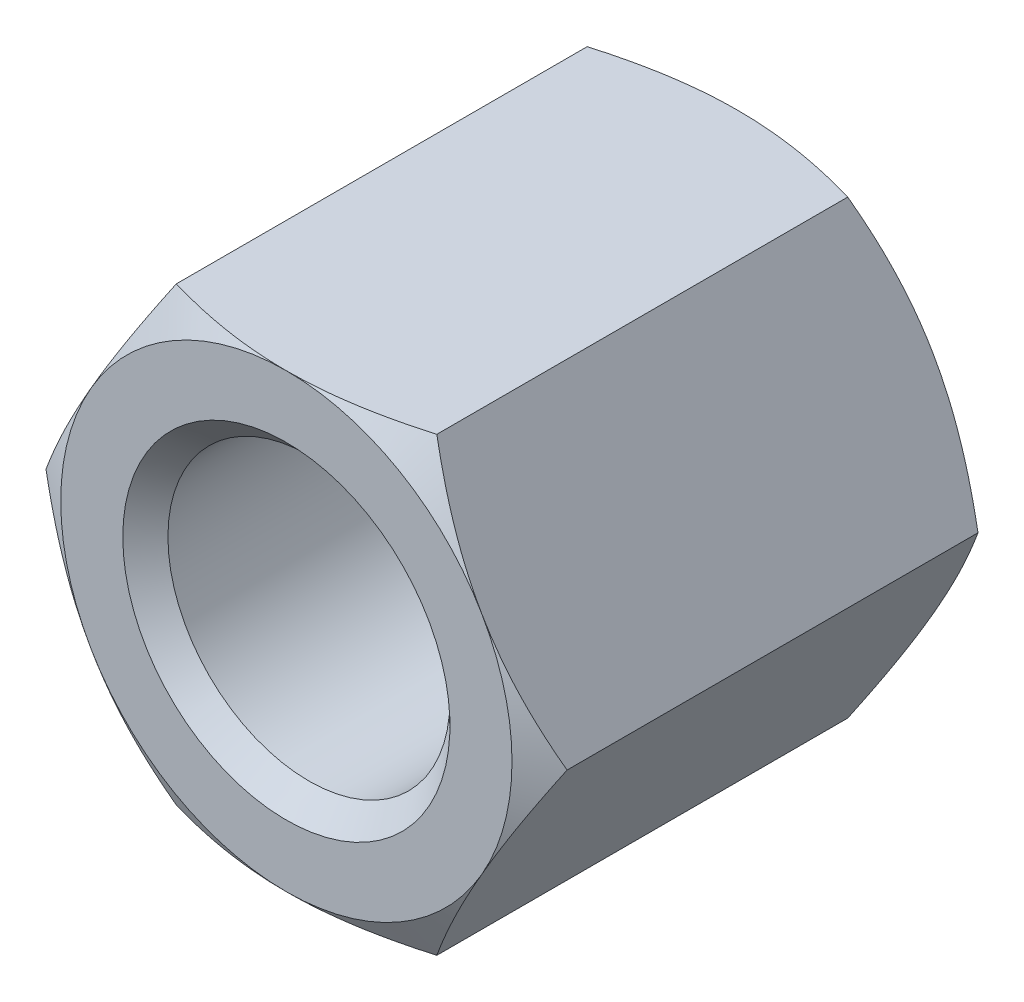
from build123d import *

# Parameters (mm, degrees)
BOSS_EXTRUDE1_DEPTH      = 4
SKETCH2_OUTSIDE_W        = 42.572
SKETCH2_OUTSIDE_H        = 41.334
SKETCH2_OUTSIDE_R        = 4
CUT_EXTRUDE1_DEPTH       = 8.302967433
CUT_EXTRUDE1_DRAFT       = -60
SKETCH3_R                = 2.5
SKETCH3_R_2              = 2.1
CUT_EXTRUDE2_DEPTH       = 4
SKETCH3_2_R              = 2.1
CUT_EXTRUDE3_DEPTH       = 5.2
CHAMFER1_SIZE            = 0.4
MIRROR1_COPY_1_SKETCH_W  = 42.572
MIRROR1_COPY_1_SKETCH_H  = 41.334
MIRROR1_COPY_1_SKETCH_R  = 4
MIRROR1_COPY_1_DEPTH     = 8.302967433
MIRROR1_COPY_1_DRAFT     = -60
CHAMFER1_OF_MIRROR1_SIZE = 0.4


with BuildPart() as part:
    # Sketch1 → Boss-Extrude1 (new body)
    with BuildSketch(Plane.XY):
        Polygon((2.309401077, 4), (-2.309401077, 4), (-4.618802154, 0), (-2.309401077, -4), (2.309401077, -4), (4.618802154, 0), align=None)
    boss_extrude1 = extrude(amount=-BOSS_EXTRUDE1_DEPTH)


with BuildPart() as cut_extrude1_tool:
    # Sketch2 outside → Cut-Extrude1 (with draft: the straight prism first)
    with BuildSketch(Plane(origin=(0, 0, -4), x_dir=(-1, 0, 0), z_dir=(0, 0, -1))):
        Rectangle(SKETCH2_OUTSIDE_W, SKETCH2_OUTSIDE_H)
        Circle(SKETCH2_OUTSIDE_R, mode=Mode.SUBTRACT)
    extrude(amount=-CUT_EXTRUDE1_DEPTH)
    # Cut-Extrude1: the draft: its side faces are tilted about the plane it starts from
    cut_extrude1_sides = [cut_extrude1_tool.faces().sort_by_distance(p)[0] for p in [
        (0, -20.667, 0.151483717),
        (-21.286, 0, 0.151483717),
        (0, 20.667, 0.151483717),
        (21.286, 0, 0.151483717),
        (4, 0, 0.151483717),
    ]]
    draft(cut_extrude1_sides, Plane(origin=(0, 0, -4), x_dir=(-1, 0, 0), z_dir=(0, 0, -1)), CUT_EXTRUDE1_DRAFT)


with BuildPart() as part_1:
    add(part.part)

    # Cut-Extrude1: cut by cut_extrude1_tool
    add(cut_extrude1_tool.part, mode=Mode.SUBTRACT)

    # Sketch3 → Cut-Extrude2 (cut)
    with BuildSketch(Plane(origin=(0, 0, -4), x_dir=(-1, 0, 0), z_dir=(0, 0, -1))):
        Circle(SKETCH3_R)
        Circle(SKETCH3_R_2, mode=Mode.SUBTRACT)
    cut_extrude2 = extrude(amount=-CUT_EXTRUDE2_DEPTH, mode=Mode.SUBTRACT)


with BuildPart() as cut_extrude2_piece_1:
    # of the separate pieces the step leaves, piece 1, a body of its own (cut_extrude2_pieces)
    add(part_1.part.solids().sort_by_distance((2.309401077, 4, 0))[0])

    # Chamfer1
    chamfer1_edges = [cut_extrude2_piece_1.edges().sort_by_distance(p)[0] for p in [
        (2.5, 0, -4),
    ]]
    chamfer(chamfer1_edges, length=CHAMFER1_SIZE)


with BuildPart() as cut_extrude2_piece_2:
    # of the separate pieces the step leaves, piece 2, a body of its own (cut_extrude2_pieces)
    add(part_1.part.solids().sort_by_distance((-2.1, 0, 0))[0])

    # Sketch3_2 → Cut-Extrude3 (cut)
    with BuildSketch(Plane(origin=(0, 0, -4), x_dir=(-1, 0, 0), z_dir=(0, 0, -1))):
        Circle(SKETCH3_2_R)
    cut_extrude3 = extrude(amount=-CUT_EXTRUDE3_DEPTH, mode=Mode.SUBTRACT)


with BuildPart() as cut_extrude2_piece_1_1:
    add(cut_extrude2_piece_1.part)

    # Mirror1: Boss-Extrude1, Cut-Extrude2, Cut-Extrude3 across plane
    add(boss_extrude1.mirror(Plane.XY))
    add(cut_extrude2.mirror(Plane.XY), mode=Mode.SUBTRACT)
    add(cut_extrude3.mirror(Plane.XY), mode=Mode.SUBTRACT)


with BuildPart() as mirror1_copy_1_tool:
    # Mirror1 copy 1 sketch → Mirror1 copy 1 (with draft: the straight prism first)
    with BuildSketch(Plane(origin=(0, 0, 4), x_dir=(-1, 0, 0), z_dir=(0, 0, 1))):
        Rectangle(MIRROR1_COPY_1_SKETCH_W, MIRROR1_COPY_1_SKETCH_H)
        Circle(MIRROR1_COPY_1_SKETCH_R, mode=Mode.SUBTRACT)
    extrude(amount=-MIRROR1_COPY_1_DEPTH)
    # Mirror1 copy 1: the draft: its side faces are tilted about the plane it starts from
    mirror1_copy_1_sides = [mirror1_copy_1_tool.faces().sort_by_distance(p)[0] for p in [
        (0, -20.667, -0.151483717),
        (-21.286, 0, -0.151483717),
        (0, 20.667, -0.151483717),
        (21.286, 0, -0.151483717),
        (4, 0, -0.151483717),
    ]]
    draft(mirror1_copy_1_sides, Plane(origin=(0, 0, 4), x_dir=(-1, 0, 0), z_dir=(0, 0, 1)), MIRROR1_COPY_1_DRAFT)


with BuildPart() as cut_extrude2_piece_1_2:
    add(cut_extrude2_piece_1_1.part)

    # Mirror1 copy 1: cut by mirror1_copy_1_tool
    add(mirror1_copy_1_tool.part, mode=Mode.SUBTRACT)

    # Chamfer1 of Mirror1
    chamfer1_of_mirror1_edges = [cut_extrude2_piece_1_2.edges().sort_by_distance(p)[0] for p in [
        (2.5, 0, 4),
    ]]
    chamfer(chamfer1_of_mirror1_edges, length=CHAMFER1_OF_MIRROR1_SIZE)


solid = cut_extrude2_piece_1_2.part
